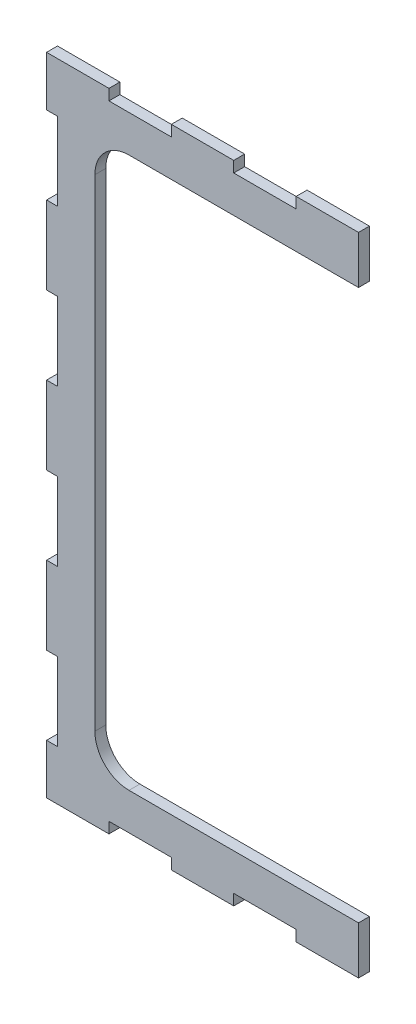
ISO-10303-21;
HEADER;
FILE_DESCRIPTION(('STEP AP214'),'2;1');
FILE_NAME('part.step','',(''),(''),'','','');
FILE_SCHEMA(('AUTOMOTIVE_DESIGN { 1 0 10303 214 1 1 1 1 }'));
ENDSEC;
DATA;
#1=APPLICATION_CONTEXT('core data for automotive mechanical design processes');
#2=APPLICATION_PROTOCOL_DEFINITION('international standard','automotive_design',2000,#1);
#3=PRODUCT_CONTEXT('',#1,'mechanical');
#4=PRODUCT('Part','Part','',(#3));
#5=PRODUCT_RELATED_PRODUCT_CATEGORY('part','',(#4));
#6=PRODUCT_DEFINITION_FORMATION('','',#4);
#7=PRODUCT_DEFINITION_CONTEXT('part definition',#1,'design');
#8=PRODUCT_DEFINITION('design','',#6,#7);
#9=PRODUCT_DEFINITION_SHAPE('','',#8);
#10=(LENGTH_UNIT() NAMED_UNIT(*) SI_UNIT(.MILLI.,.METRE.));
#11=(NAMED_UNIT(*) PLANE_ANGLE_UNIT() SI_UNIT($,.RADIAN.));
#12=(NAMED_UNIT(*) SI_UNIT($,.STERADIAN.) SOLID_ANGLE_UNIT());
#13=UNCERTAINTY_MEASURE_WITH_UNIT(LENGTH_MEASURE(1.E-05),#10,'distance_accuracy_value','');
#14=(GEOMETRIC_REPRESENTATION_CONTEXT(3) GLOBAL_UNCERTAINTY_ASSIGNED_CONTEXT((#13)) GLOBAL_UNIT_ASSIGNED_CONTEXT((#10,
#11,#12)) REPRESENTATION_CONTEXT('',''));
#15=CARTESIAN_POINT('',(0.,0.,0.));
#16=DIRECTION('',(0.,0.,1.));
#17=DIRECTION('',(1.,0.,0.));
#18=AXIS2_PLACEMENT_3D('',#15,#16,#17);
#19=CARTESIAN_POINT('',(-494.301446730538,497.074365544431,16.));
#20=DIRECTION('',(-1.,0.,0.));
#21=DIRECTION('',(0.,-1.,0.));
#22=AXIS2_PLACEMENT_3D('',#19,#20,#21);
#23=PLANE('',#22);
#24=DIRECTION('',(0.,1.,0.));
#25=VECTOR('',#24,1.);
#26=CARTESIAN_POINT('',(-494.301446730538,497.074365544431,0.));
#27=LINE('',#26,#25);
#28=CARTESIAN_POINT('',(-494.301446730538,497.074365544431,0.));
#29=VERTEX_POINT('',#28);
#30=CARTESIAN_POINT('',(-494.301446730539,513.074365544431,0.));
#31=VERTEX_POINT('',#30);
#32=EDGE_CURVE('E325',#29,#31,#27,.T.);
#33=ORIENTED_EDGE('',*,*,#32,.T.);
#34=DIRECTION('',(0.,0.,-1.));
#35=VECTOR('',#34,1.);
#36=CARTESIAN_POINT('',(-494.301446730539,513.074365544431,16.));
#37=LINE('',#36,#35);
#38=CARTESIAN_POINT('',(-494.301446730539,513.074365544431,16.));
#39=VERTEX_POINT('',#38);
#40=EDGE_CURVE('E306',#39,#31,#37,.T.);
#41=ORIENTED_EDGE('',*,*,#40,.F.);
#42=DIRECTION('',(0.,1.,0.));
#43=VECTOR('',#42,1.);
#44=CARTESIAN_POINT('',(-494.301446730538,497.074365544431,16.));
#45=LINE('',#44,#43);
#46=CARTESIAN_POINT('',(-494.301446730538,497.074365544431,16.));
#47=VERTEX_POINT('',#46);
#48=EDGE_CURVE('E313',#47,#39,#45,.T.);
#49=ORIENTED_EDGE('',*,*,#48,.F.);
#50=DIRECTION('',(0.,0.,-1.));
#51=VECTOR('',#50,1.);
#52=CARTESIAN_POINT('',(-494.301446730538,497.074365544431,16.));
#53=LINE('',#52,#51);
#54=EDGE_CURVE('E392',#47,#29,#53,.T.);
#55=ORIENTED_EDGE('',*,*,#54,.T.);
#56=EDGE_LOOP('',(#33,#41,#49,#55));
#57=FACE_BOUND('',#56,.T.);
#58=ADVANCED_FACE('F33',(#57),#23,.F.);
#59=CARTESIAN_POINT('',(-585.741446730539,513.074365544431,16.));
#60=DIRECTION('',(0.,-1.,0.));
#61=DIRECTION('',(0.,0.,-1.));
#62=AXIS2_PLACEMENT_3D('',#59,#60,#61);
#63=PLANE('',#62);
#64=DIRECTION('',(-1.,0.,0.));
#65=VECTOR('',#64,1.);
#66=CARTESIAN_POINT('',(-585.741446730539,513.074365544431,0.));
#67=LINE('',#66,#65);
#68=CARTESIAN_POINT('',(-585.741446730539,513.074365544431,0.));
#69=VERTEX_POINT('',#68);
#70=EDGE_CURVE('E511',#31,#69,#67,.T.);
#71=ORIENTED_EDGE('',*,*,#70,.T.);
#72=DIRECTION('',(0.,0.,-1.));
#73=VECTOR('',#72,1.);
#74=CARTESIAN_POINT('',(-585.741446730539,513.074365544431,16.));
#75=LINE('',#74,#73);
#76=CARTESIAN_POINT('',(-585.741446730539,513.074365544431,16.));
#77=VERTEX_POINT('',#76);
#78=EDGE_CURVE('E309',#77,#69,#75,.T.);
#79=ORIENTED_EDGE('',*,*,#78,.F.);
#80=DIRECTION('',(-1.,0.,0.));
#81=VECTOR('',#80,1.);
#82=CARTESIAN_POINT('',(-585.741446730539,513.074365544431,16.));
#83=LINE('',#82,#81);
#84=EDGE_CURVE('E302',#39,#77,#83,.T.);
#85=ORIENTED_EDGE('',*,*,#84,.F.);
#86=ORIENTED_EDGE('',*,*,#40,.T.);
#87=EDGE_LOOP('',(#71,#79,#85,#86));
#88=FACE_BOUND('',#87,.T.);
#89=ADVANCED_FACE('F304',(#88),#63,.F.);
#90=CARTESIAN_POINT('',(-585.741446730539,439.922365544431,16.));
#91=DIRECTION('',(1.,0.,0.));
#92=DIRECTION('',(0.,0.,-1.));
#93=AXIS2_PLACEMENT_3D('',#90,#91,#92);
#94=PLANE('',#93);
#95=DIRECTION('',(0.,-1.,0.));
#96=VECTOR('',#95,1.);
#97=CARTESIAN_POINT('',(-585.741446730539,439.922365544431,0.));
#98=LINE('',#97,#96);
#99=CARTESIAN_POINT('',(-585.741446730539,439.922365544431,0.));
#100=VERTEX_POINT('',#99);
#101=EDGE_CURVE('E505',#69,#100,#98,.T.);
#102=ORIENTED_EDGE('',*,*,#101,.T.);
#103=DIRECTION('',(0.,0.,-1.));
#104=VECTOR('',#103,1.);
#105=CARTESIAN_POINT('',(-585.741446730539,439.922365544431,16.));
#106=LINE('',#105,#104);
#107=CARTESIAN_POINT('',(-585.741446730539,439.922365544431,16.));
#108=VERTEX_POINT('',#107);
#109=EDGE_CURVE('E331',#108,#100,#106,.T.);
#110=ORIENTED_EDGE('',*,*,#109,.F.);
#111=DIRECTION('',(0.,-1.,0.));
#112=VECTOR('',#111,1.);
#113=CARTESIAN_POINT('',(-585.741446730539,439.922365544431,16.));
#114=LINE('',#113,#112);
#115=EDGE_CURVE('E312',#77,#108,#114,.T.);
#116=ORIENTED_EDGE('',*,*,#115,.F.);
#117=ORIENTED_EDGE('',*,*,#78,.T.);
#118=EDGE_LOOP('',(#102,#110,#116,#117));
#119=FACE_BOUND('',#118,.T.);
#120=ADVANCED_FACE('F590',(#119),#94,.F.);
#121=CARTESIAN_POINT('',(-585.741446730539,439.922365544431,16.));
#122=DIRECTION('',(0.,1.,0.));
#123=DIRECTION('',(-1.,0.,0.));
#124=AXIS2_PLACEMENT_3D('',#121,#122,#123);
#125=PLANE('',#124);
#126=DIRECTION('',(1.,0.,0.));
#127=VECTOR('',#126,1.);
#128=CARTESIAN_POINT('',(-585.741446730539,439.922365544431,0.));
#129=LINE('',#128,#127);
#130=CARTESIAN_POINT('',(-569.741446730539,439.922365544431,0.));
#131=VERTEX_POINT('',#130);
#132=EDGE_CURVE('E500',#100,#131,#129,.T.);
#133=ORIENTED_EDGE('',*,*,#132,.T.);
#134=DIRECTION('',(0.,0.,-1.));
#135=VECTOR('',#134,1.);
#136=CARTESIAN_POINT('',(-569.741446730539,439.922365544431,16.));
#137=LINE('',#136,#135);
#138=CARTESIAN_POINT('',(-569.741446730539,439.922365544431,16.));
#139=VERTEX_POINT('',#138);
#140=EDGE_CURVE('E491',#139,#131,#137,.T.);
#141=ORIENTED_EDGE('',*,*,#140,.F.);
#142=DIRECTION('',(1.,0.,0.));
#143=VECTOR('',#142,1.);
#144=CARTESIAN_POINT('',(-585.741446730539,439.922365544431,16.));
#145=LINE('',#144,#143);
#146=EDGE_CURVE('E501',#108,#139,#145,.T.);
#147=ORIENTED_EDGE('',*,*,#146,.F.);
#148=ORIENTED_EDGE('',*,*,#109,.T.);
#149=EDGE_LOOP('',(#133,#141,#147,#148));
#150=FACE_BOUND('',#149,.T.);
#151=ADVANCED_FACE('F498',(#150),#125,.F.);
#152=CARTESIAN_POINT('',(-569.741446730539,439.922365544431,16.));
#153=DIRECTION('',(1.,0.,0.));
#154=DIRECTION('',(0.,0.,-1.));
#155=AXIS2_PLACEMENT_3D('',#152,#153,#154);
#156=PLANE('',#155);
#157=DIRECTION('',(0.,-1.,0.));
#158=VECTOR('',#157,1.);
#159=CARTESIAN_POINT('',(-569.741446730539,439.922365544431,0.));
#160=LINE('',#159,#158);
#161=CARTESIAN_POINT('',(-569.741446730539,325.622365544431,0.));
#162=VERTEX_POINT('',#161);
#163=EDGE_CURVE('E507',#131,#162,#160,.T.);
#164=ORIENTED_EDGE('',*,*,#163,.T.);
#165=DIRECTION('',(0.,0.,-1.));
#166=VECTOR('',#165,1.);
#167=CARTESIAN_POINT('',(-569.741446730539,325.622365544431,16.));
#168=LINE('',#167,#166);
#169=CARTESIAN_POINT('',(-569.741446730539,325.622365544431,16.));
#170=VERTEX_POINT('',#169);
#171=EDGE_CURVE('E488',#170,#162,#168,.T.);
#172=ORIENTED_EDGE('',*,*,#171,.F.);
#173=DIRECTION('',(0.,-1.,0.));
#174=VECTOR('',#173,1.);
#175=CARTESIAN_POINT('',(-569.741446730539,439.922365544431,16.));
#176=LINE('',#175,#174);
#177=EDGE_CURVE('E592',#139,#170,#176,.T.);
#178=ORIENTED_EDGE('',*,*,#177,.F.);
#179=ORIENTED_EDGE('',*,*,#140,.T.);
#180=EDGE_LOOP('',(#164,#172,#178,#179));
#181=FACE_BOUND('',#180,.T.);
#182=ADVANCED_FACE('F754',(#181),#156,.F.);
#183=CARTESIAN_POINT('',(-585.741446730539,325.622365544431,16.));
#184=DIRECTION('',(0.,-1.,0.));
#185=DIRECTION('',(1.,0.,0.));
#186=AXIS2_PLACEMENT_3D('',#183,#184,#185);
#187=PLANE('',#186);
#188=DIRECTION('',(-1.,0.,0.));
#189=VECTOR('',#188,1.);
#190=CARTESIAN_POINT('',(-585.741446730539,325.622365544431,0.));
#191=LINE('',#190,#189);
#192=CARTESIAN_POINT('',(-585.741446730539,325.622365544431,0.));
#193=VERTEX_POINT('',#192);
#194=EDGE_CURVE('E509',#162,#193,#191,.T.);
#195=ORIENTED_EDGE('',*,*,#194,.T.);
#196=DIRECTION('',(0.,0.,-1.));
#197=VECTOR('',#196,1.);
#198=CARTESIAN_POINT('',(-585.741446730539,325.622365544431,16.));
#199=LINE('',#198,#197);
#200=CARTESIAN_POINT('',(-585.741446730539,325.622365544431,16.));
#201=VERTEX_POINT('',#200);
#202=EDGE_CURVE('E485',#201,#193,#199,.T.);
#203=ORIENTED_EDGE('',*,*,#202,.F.);
#204=DIRECTION('',(-1.,0.,0.));
#205=VECTOR('',#204,1.);
#206=CARTESIAN_POINT('',(-585.741446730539,325.622365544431,16.));
#207=LINE('',#206,#205);
#208=EDGE_CURVE('E596',#170,#201,#207,.T.);
#209=ORIENTED_EDGE('',*,*,#208,.F.);
#210=ORIENTED_EDGE('',*,*,#171,.T.);
#211=EDGE_LOOP('',(#195,#203,#209,#210));
#212=FACE_BOUND('',#211,.T.);
#213=ADVANCED_FACE('F749',(#212),#187,.F.);
#214=CARTESIAN_POINT('',(-585.741446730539,325.622365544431,16.));
#215=DIRECTION('',(1.,0.,0.));
#216=DIRECTION('',(0.,0.,-1.));
#217=AXIS2_PLACEMENT_3D('',#214,#215,#216);
#218=PLANE('',#217);
#219=DIRECTION('',(0.,-1.,0.));
#220=VECTOR('',#219,1.);
#221=CARTESIAN_POINT('',(-585.741446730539,325.622365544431,0.));
#222=LINE('',#221,#220);
#223=CARTESIAN_POINT('',(-585.741446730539,211.323698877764,0.));
#224=VERTEX_POINT('',#223);
#225=EDGE_CURVE('E516',#193,#224,#222,.T.);
#226=ORIENTED_EDGE('',*,*,#225,.T.);
#227=DIRECTION('',(0.,0.,-1.));
#228=VECTOR('',#227,1.);
#229=CARTESIAN_POINT('',(-585.741446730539,211.323698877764,16.));
#230=LINE('',#229,#228);
#231=CARTESIAN_POINT('',(-585.741446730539,211.323698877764,16.));
#232=VERTEX_POINT('',#231);
#233=EDGE_CURVE('E482',#232,#224,#230,.T.);
#234=ORIENTED_EDGE('',*,*,#233,.F.);
#235=DIRECTION('',(0.,-1.,0.));
#236=VECTOR('',#235,1.);
#237=CARTESIAN_POINT('',(-585.741446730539,325.622365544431,16.));
#238=LINE('',#237,#236);
#239=EDGE_CURVE('E598',#201,#232,#238,.T.);
#240=ORIENTED_EDGE('',*,*,#239,.F.);
#241=ORIENTED_EDGE('',*,*,#202,.T.);
#242=EDGE_LOOP('',(#226,#234,#240,#241));
#243=FACE_BOUND('',#242,.T.);
#244=ADVANCED_FACE('F746',(#243),#218,.F.);
#245=CARTESIAN_POINT('',(-585.741446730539,211.323698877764,16.));
#246=DIRECTION('',(0.,1.,0.));
#247=DIRECTION('',(-1.,0.,0.));
#248=AXIS2_PLACEMENT_3D('',#245,#246,#247);
#249=PLANE('',#248);
#250=DIRECTION('',(1.,0.,0.));
#251=VECTOR('',#250,1.);
#252=CARTESIAN_POINT('',(-585.741446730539,211.323698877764,0.));
#253=LINE('',#252,#251);
#254=CARTESIAN_POINT('',(-569.741446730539,211.323698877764,0.));
#255=VERTEX_POINT('',#254);
#256=EDGE_CURVE('E518',#224,#255,#253,.T.);
#257=ORIENTED_EDGE('',*,*,#256,.T.);
#258=DIRECTION('',(0.,0.,-1.));
#259=VECTOR('',#258,1.);
#260=CARTESIAN_POINT('',(-569.741446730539,211.323698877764,16.));
#261=LINE('',#260,#259);
#262=CARTESIAN_POINT('',(-569.741446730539,211.323698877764,16.));
#263=VERTEX_POINT('',#262);
#264=EDGE_CURVE('E479',#263,#255,#261,.T.);
#265=ORIENTED_EDGE('',*,*,#264,.F.);
#266=DIRECTION('',(1.,0.,0.));
#267=VECTOR('',#266,1.);
#268=CARTESIAN_POINT('',(-585.741446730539,211.323698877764,16.));
#269=LINE('',#268,#267);
#270=EDGE_CURVE('E600',#232,#263,#269,.T.);
#271=ORIENTED_EDGE('',*,*,#270,.F.);
#272=ORIENTED_EDGE('',*,*,#233,.T.);
#273=EDGE_LOOP('',(#257,#265,#271,#272));
#274=FACE_BOUND('',#273,.T.);
#275=ADVANCED_FACE('F742',(#274),#249,.F.);
#276=CARTESIAN_POINT('',(-569.741446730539,211.323698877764,16.));
#277=DIRECTION('',(1.,0.,0.));
#278=DIRECTION('',(0.,0.,-1.));
#279=AXIS2_PLACEMENT_3D('',#276,#277,#278);
#280=PLANE('',#279);
#281=DIRECTION('',(0.,-1.,0.));
#282=VECTOR('',#281,1.);
#283=CARTESIAN_POINT('',(-569.741446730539,211.323698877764,0.));
#284=LINE('',#283,#282);
#285=CARTESIAN_POINT('',(-569.741446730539,97.0236988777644,0.));
#286=VERTEX_POINT('',#285);
#287=EDGE_CURVE('E520',#255,#286,#284,.T.);
#288=ORIENTED_EDGE('',*,*,#287,.T.);
#289=DIRECTION('',(0.,0.,-1.));
#290=VECTOR('',#289,1.);
#291=CARTESIAN_POINT('',(-569.741446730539,97.0236988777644,16.));
#292=LINE('',#291,#290);
#293=CARTESIAN_POINT('',(-569.741446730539,97.0236988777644,16.));
#294=VERTEX_POINT('',#293);
#295=EDGE_CURVE('E476',#294,#286,#292,.T.);
#296=ORIENTED_EDGE('',*,*,#295,.F.);
#297=DIRECTION('',(0.,-1.,0.));
#298=VECTOR('',#297,1.);
#299=CARTESIAN_POINT('',(-569.741446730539,211.323698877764,16.));
#300=LINE('',#299,#298);
#301=EDGE_CURVE('E602',#263,#294,#300,.T.);
#302=ORIENTED_EDGE('',*,*,#301,.F.);
#303=ORIENTED_EDGE('',*,*,#264,.T.);
#304=EDGE_LOOP('',(#288,#296,#302,#303));
#305=FACE_BOUND('',#304,.T.);
#306=ADVANCED_FACE('F737',(#305),#280,.F.);
#307=CARTESIAN_POINT('',(-585.741446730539,97.0236988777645,16.));
#308=DIRECTION('',(0.,-1.,0.));
#309=DIRECTION('',(1.,0.,0.));
#310=AXIS2_PLACEMENT_3D('',#307,#308,#309);
#311=PLANE('',#310);
#312=DIRECTION('',(-1.,0.,0.));
#313=VECTOR('',#312,1.);
#314=CARTESIAN_POINT('',(-585.741446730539,97.0236988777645,0.));
#315=LINE('',#314,#313);
#316=CARTESIAN_POINT('',(-585.741446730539,97.0236988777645,0.));
#317=VERTEX_POINT('',#316);
#318=EDGE_CURVE('E522',#286,#317,#315,.T.);
#319=ORIENTED_EDGE('',*,*,#318,.T.);
#320=DIRECTION('',(0.,0.,-1.));
#321=VECTOR('',#320,1.);
#322=CARTESIAN_POINT('',(-585.741446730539,97.0236988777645,16.));
#323=LINE('',#322,#321);
#324=CARTESIAN_POINT('',(-585.741446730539,97.0236988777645,16.));
#325=VERTEX_POINT('',#324);
#326=EDGE_CURVE('E473',#325,#317,#323,.T.);
#327=ORIENTED_EDGE('',*,*,#326,.F.);
#328=DIRECTION('',(-1.,0.,0.));
#329=VECTOR('',#328,1.);
#330=CARTESIAN_POINT('',(-585.741446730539,97.0236988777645,16.));
#331=LINE('',#330,#329);
#332=EDGE_CURVE('E604',#294,#325,#331,.T.);
#333=ORIENTED_EDGE('',*,*,#332,.F.);
#334=ORIENTED_EDGE('',*,*,#295,.T.);
#335=EDGE_LOOP('',(#319,#327,#333,#334));
#336=FACE_BOUND('',#335,.T.);
#337=ADVANCED_FACE('F731',(#336),#311,.F.);
#338=CARTESIAN_POINT('',(-585.741446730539,-17.2749677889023,16.));
#339=DIRECTION('',(1.,0.,0.));
#340=DIRECTION('',(0.,0.,-1.));
#341=AXIS2_PLACEMENT_3D('',#338,#339,#340);
#342=PLANE('',#341);
#343=DIRECTION('',(0.,-1.,0.));
#344=VECTOR('',#343,1.);
#345=CARTESIAN_POINT('',(-585.741446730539,-17.2749677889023,0.));
#346=LINE('',#345,#344);
#347=CARTESIAN_POINT('',(-585.741446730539,-17.2749677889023,0.));
#348=VERTEX_POINT('',#347);
#349=EDGE_CURVE('E524',#317,#348,#346,.T.);
#350=ORIENTED_EDGE('',*,*,#349,.T.);
#351=DIRECTION('',(0.,0.,-1.));
#352=VECTOR('',#351,1.);
#353=CARTESIAN_POINT('',(-585.741446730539,-17.2749677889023,16.));
#354=LINE('',#353,#352);
#355=CARTESIAN_POINT('',(-585.741446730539,-17.2749677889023,16.));
#356=VERTEX_POINT('',#355);
#357=EDGE_CURVE('E470',#356,#348,#354,.T.);
#358=ORIENTED_EDGE('',*,*,#357,.F.);
#359=DIRECTION('',(0.,-1.,0.));
#360=VECTOR('',#359,1.);
#361=CARTESIAN_POINT('',(-585.741446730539,-17.2749677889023,16.));
#362=LINE('',#361,#360);
#363=EDGE_CURVE('E606',#325,#356,#362,.T.);
#364=ORIENTED_EDGE('',*,*,#363,.F.);
#365=ORIENTED_EDGE('',*,*,#326,.T.);
#366=EDGE_LOOP('',(#350,#358,#364,#365));
#367=FACE_BOUND('',#366,.T.);
#368=ADVANCED_FACE('F727',(#367),#342,.F.);
#369=CARTESIAN_POINT('',(-585.741446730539,-17.2749677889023,16.));
#370=DIRECTION('',(0.,1.,0.));
#371=DIRECTION('',(-1.,0.,0.));
#372=AXIS2_PLACEMENT_3D('',#369,#370,#371);
#373=PLANE('',#372);
#374=DIRECTION('',(1.,0.,0.));
#375=VECTOR('',#374,1.);
#376=CARTESIAN_POINT('',(-585.741446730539,-17.2749677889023,0.));
#377=LINE('',#376,#375);
#378=CARTESIAN_POINT('',(-569.741446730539,-17.2749677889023,0.));
#379=VERTEX_POINT('',#378);
#380=EDGE_CURVE('E526',#348,#379,#377,.T.);
#381=ORIENTED_EDGE('',*,*,#380,.T.);
#382=DIRECTION('',(0.,0.,-1.));
#383=VECTOR('',#382,1.);
#384=CARTESIAN_POINT('',(-569.741446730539,-17.2749677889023,16.));
#385=LINE('',#384,#383);
#386=CARTESIAN_POINT('',(-569.741446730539,-17.2749677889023,16.));
#387=VERTEX_POINT('',#386);
#388=EDGE_CURVE('E467',#387,#379,#385,.T.);
#389=ORIENTED_EDGE('',*,*,#388,.F.);
#390=DIRECTION('',(1.,0.,0.));
#391=VECTOR('',#390,1.);
#392=CARTESIAN_POINT('',(-585.741446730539,-17.2749677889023,16.));
#393=LINE('',#392,#391);
#394=EDGE_CURVE('E608',#356,#387,#393,.T.);
#395=ORIENTED_EDGE('',*,*,#394,.F.);
#396=ORIENTED_EDGE('',*,*,#357,.T.);
#397=EDGE_LOOP('',(#381,#389,#395,#396));
#398=FACE_BOUND('',#397,.T.);
#399=ADVANCED_FACE('F722',(#398),#373,.F.);
#400=CARTESIAN_POINT('',(-569.741446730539,-17.2749677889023,16.));
#401=DIRECTION('',(1.,0.,0.));
#402=DIRECTION('',(0.,0.,-1.));
#403=AXIS2_PLACEMENT_3D('',#400,#401,#402);
#404=PLANE('',#403);
#405=DIRECTION('',(0.,-1.,0.));
#406=VECTOR('',#405,1.);
#407=CARTESIAN_POINT('',(-569.741446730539,-17.2749677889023,0.));
#408=LINE('',#407,#406);
#409=CARTESIAN_POINT('',(-569.741446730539,-131.574967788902,0.));
#410=VERTEX_POINT('',#409);
#411=EDGE_CURVE('E528',#379,#410,#408,.T.);
#412=ORIENTED_EDGE('',*,*,#411,.T.);
#413=DIRECTION('',(0.,0.,-1.));
#414=VECTOR('',#413,1.);
#415=CARTESIAN_POINT('',(-569.741446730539,-131.574967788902,16.));
#416=LINE('',#415,#414);
#417=CARTESIAN_POINT('',(-569.741446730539,-131.574967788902,16.));
#418=VERTEX_POINT('',#417);
#419=EDGE_CURVE('E464',#418,#410,#416,.T.);
#420=ORIENTED_EDGE('',*,*,#419,.F.);
#421=DIRECTION('',(0.,-1.,0.));
#422=VECTOR('',#421,1.);
#423=CARTESIAN_POINT('',(-569.741446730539,-17.2749677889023,16.));
#424=LINE('',#423,#422);
#425=EDGE_CURVE('E610',#387,#418,#424,.T.);
#426=ORIENTED_EDGE('',*,*,#425,.F.);
#427=ORIENTED_EDGE('',*,*,#388,.T.);
#428=EDGE_LOOP('',(#412,#420,#426,#427));
#429=FACE_BOUND('',#428,.T.);
#430=ADVANCED_FACE('F716',(#429),#404,.F.);
#431=CARTESIAN_POINT('',(-585.741446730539,-131.574967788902,16.));
#432=DIRECTION('',(0.,-1.,0.));
#433=DIRECTION('',(1.,0.,0.));
#434=AXIS2_PLACEMENT_3D('',#431,#432,#433);
#435=PLANE('',#434);
#436=DIRECTION('',(-1.,0.,0.));
#437=VECTOR('',#436,1.);
#438=CARTESIAN_POINT('',(-585.741446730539,-131.574967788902,0.));
#439=LINE('',#438,#437);
#440=CARTESIAN_POINT('',(-585.741446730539,-131.574967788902,0.));
#441=VERTEX_POINT('',#440);
#442=EDGE_CURVE('E530',#410,#441,#439,.T.);
#443=ORIENTED_EDGE('',*,*,#442,.T.);
#444=DIRECTION('',(0.,0.,-1.));
#445=VECTOR('',#444,1.);
#446=CARTESIAN_POINT('',(-585.741446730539,-131.574967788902,16.));
#447=LINE('',#446,#445);
#448=CARTESIAN_POINT('',(-585.741446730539,-131.574967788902,16.));
#449=VERTEX_POINT('',#448);
#450=EDGE_CURVE('E461',#449,#441,#447,.T.);
#451=ORIENTED_EDGE('',*,*,#450,.F.);
#452=DIRECTION('',(-1.,0.,0.));
#453=VECTOR('',#452,1.);
#454=CARTESIAN_POINT('',(-585.741446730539,-131.574967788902,16.));
#455=LINE('',#454,#453);
#456=EDGE_CURVE('E612',#418,#449,#455,.T.);
#457=ORIENTED_EDGE('',*,*,#456,.F.);
#458=ORIENTED_EDGE('',*,*,#419,.T.);
#459=EDGE_LOOP('',(#443,#451,#457,#458));
#460=FACE_BOUND('',#459,.T.);
#461=ADVANCED_FACE('F712',(#460),#435,.F.);
#462=CARTESIAN_POINT('',(-585.741446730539,-245.873634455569,16.));
#463=DIRECTION('',(1.,0.,0.));
#464=DIRECTION('',(0.,0.,-1.));
#465=AXIS2_PLACEMENT_3D('',#462,#463,#464);
#466=PLANE('',#465);
#467=DIRECTION('',(0.,-1.,0.));
#468=VECTOR('',#467,1.);
#469=CARTESIAN_POINT('',(-585.741446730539,-245.873634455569,0.));
#470=LINE('',#469,#468);
#471=CARTESIAN_POINT('',(-585.741446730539,-245.873634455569,0.));
#472=VERTEX_POINT('',#471);
#473=EDGE_CURVE('E532',#441,#472,#470,.T.);
#474=ORIENTED_EDGE('',*,*,#473,.T.);
#475=DIRECTION('',(0.,0.,-1.));
#476=VECTOR('',#475,1.);
#477=CARTESIAN_POINT('',(-585.741446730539,-245.873634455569,16.));
#478=LINE('',#477,#476);
#479=CARTESIAN_POINT('',(-585.741446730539,-245.873634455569,16.));
#480=VERTEX_POINT('',#479);
#481=EDGE_CURVE('E458',#480,#472,#478,.T.);
#482=ORIENTED_EDGE('',*,*,#481,.F.);
#483=DIRECTION('',(0.,-1.,0.));
#484=VECTOR('',#483,1.);
#485=CARTESIAN_POINT('',(-585.741446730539,-245.873634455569,16.));
#486=LINE('',#485,#484);
#487=EDGE_CURVE('E614',#449,#480,#486,.T.);
#488=ORIENTED_EDGE('',*,*,#487,.F.);
#489=ORIENTED_EDGE('',*,*,#450,.T.);
#490=EDGE_LOOP('',(#474,#482,#488,#489));
#491=FACE_BOUND('',#490,.T.);
#492=ADVANCED_FACE('F707',(#491),#466,.F.);
#493=CARTESIAN_POINT('',(-585.741446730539,-245.873634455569,16.));
#494=DIRECTION('',(0.,1.,0.));
#495=DIRECTION('',(-1.,0.,0.));
#496=AXIS2_PLACEMENT_3D('',#493,#494,#495);
#497=PLANE('',#496);
#498=DIRECTION('',(1.,0.,0.));
#499=VECTOR('',#498,1.);
#500=CARTESIAN_POINT('',(-585.741446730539,-245.873634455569,0.));
#501=LINE('',#500,#499);
#502=CARTESIAN_POINT('',(-569.741446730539,-245.873634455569,0.));
#503=VERTEX_POINT('',#502);
#504=EDGE_CURVE('E534',#472,#503,#501,.T.);
#505=ORIENTED_EDGE('',*,*,#504,.T.);
#506=DIRECTION('',(0.,0.,-1.));
#507=VECTOR('',#506,1.);
#508=CARTESIAN_POINT('',(-569.741446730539,-245.873634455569,16.));
#509=LINE('',#508,#507);
#510=CARTESIAN_POINT('',(-569.741446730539,-245.873634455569,16.));
#511=VERTEX_POINT('',#510);
#512=EDGE_CURVE('E455',#511,#503,#509,.T.);
#513=ORIENTED_EDGE('',*,*,#512,.F.);
#514=DIRECTION('',(1.,0.,0.));
#515=VECTOR('',#514,1.);
#516=CARTESIAN_POINT('',(-585.741446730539,-245.873634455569,16.));
#517=LINE('',#516,#515);
#518=EDGE_CURVE('E616',#480,#511,#517,.T.);
#519=ORIENTED_EDGE('',*,*,#518,.F.);
#520=ORIENTED_EDGE('',*,*,#481,.T.);
#521=EDGE_LOOP('',(#505,#513,#519,#520));
#522=FACE_BOUND('',#521,.T.);
#523=ADVANCED_FACE('F701',(#522),#497,.F.);
#524=CARTESIAN_POINT('',(-569.741446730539,-245.873634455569,16.));
#525=DIRECTION('',(1.,0.,0.));
#526=DIRECTION('',(0.,0.,-1.));
#527=AXIS2_PLACEMENT_3D('',#524,#525,#526);
#528=PLANE('',#527);
#529=DIRECTION('',(0.,-1.,0.));
#530=VECTOR('',#529,1.);
#531=CARTESIAN_POINT('',(-569.741446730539,-245.873634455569,0.));
#532=LINE('',#531,#530);
#533=CARTESIAN_POINT('',(-569.741446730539,-360.173634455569,0.));
#534=VERTEX_POINT('',#533);
#535=EDGE_CURVE('E536',#503,#534,#532,.T.);
#536=ORIENTED_EDGE('',*,*,#535,.T.);
#537=DIRECTION('',(0.,0.,-1.));
#538=VECTOR('',#537,1.);
#539=CARTESIAN_POINT('',(-569.741446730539,-360.173634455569,16.));
#540=LINE('',#539,#538);
#541=CARTESIAN_POINT('',(-569.741446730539,-360.173634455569,16.));
#542=VERTEX_POINT('',#541);
#543=EDGE_CURVE('E452',#542,#534,#540,.T.);
#544=ORIENTED_EDGE('',*,*,#543,.F.);
#545=DIRECTION('',(0.,-1.,0.));
#546=VECTOR('',#545,1.);
#547=CARTESIAN_POINT('',(-569.741446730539,-245.873634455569,16.));
#548=LINE('',#547,#546);
#549=EDGE_CURVE('E618',#511,#542,#548,.T.);
#550=ORIENTED_EDGE('',*,*,#549,.F.);
#551=ORIENTED_EDGE('',*,*,#512,.T.);
#552=EDGE_LOOP('',(#536,#544,#550,#551));
#553=FACE_BOUND('',#552,.T.);
#554=ADVANCED_FACE('F697',(#553),#528,.F.);
#555=CARTESIAN_POINT('',(-585.741446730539,-360.173634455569,16.));
#556=DIRECTION('',(0.,-1.,0.));
#557=DIRECTION('',(1.,0.,0.));
#558=AXIS2_PLACEMENT_3D('',#555,#556,#557);
#559=PLANE('',#558);
#560=DIRECTION('',(-1.,0.,0.));
#561=VECTOR('',#560,1.);
#562=CARTESIAN_POINT('',(-585.741446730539,-360.173634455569,0.));
#563=LINE('',#562,#561);
#564=CARTESIAN_POINT('',(-585.741446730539,-360.173634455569,0.));
#565=VERTEX_POINT('',#564);
#566=EDGE_CURVE('E538',#534,#565,#563,.T.);
#567=ORIENTED_EDGE('',*,*,#566,.T.);
#568=DIRECTION('',(0.,0.,-1.));
#569=VECTOR('',#568,1.);
#570=CARTESIAN_POINT('',(-585.741446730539,-360.173634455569,16.));
#571=LINE('',#570,#569);
#572=CARTESIAN_POINT('',(-585.741446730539,-360.173634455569,16.));
#573=VERTEX_POINT('',#572);
#574=EDGE_CURVE('E449',#573,#565,#571,.T.);
#575=ORIENTED_EDGE('',*,*,#574,.F.);
#576=DIRECTION('',(-1.,0.,0.));
#577=VECTOR('',#576,1.);
#578=CARTESIAN_POINT('',(-585.741446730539,-360.173634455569,16.));
#579=LINE('',#578,#577);
#580=EDGE_CURVE('E620',#542,#573,#579,.T.);
#581=ORIENTED_EDGE('',*,*,#580,.F.);
#582=ORIENTED_EDGE('',*,*,#543,.T.);
#583=EDGE_LOOP('',(#567,#575,#581,#582));
#584=FACE_BOUND('',#583,.T.);
#585=ADVANCED_FACE('F692',(#584),#559,.F.);
#586=CARTESIAN_POINT('',(-585.741446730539,-433.325634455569,16.));
#587=DIRECTION('',(1.,0.,0.));
#588=DIRECTION('',(0.,0.,-1.));
#589=AXIS2_PLACEMENT_3D('',#586,#587,#588);
#590=PLANE('',#589);
#591=DIRECTION('',(0.,-1.,0.));
#592=VECTOR('',#591,1.);
#593=CARTESIAN_POINT('',(-585.741446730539,-433.325634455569,0.));
#594=LINE('',#593,#592);
#595=CARTESIAN_POINT('',(-585.741446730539,-433.325634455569,0.));
#596=VERTEX_POINT('',#595);
#597=EDGE_CURVE('E540',#565,#596,#594,.T.);
#598=ORIENTED_EDGE('',*,*,#597,.T.);
#599=DIRECTION('',(0.,0.,-1.));
#600=VECTOR('',#599,1.);
#601=CARTESIAN_POINT('',(-585.741446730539,-433.325634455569,16.));
#602=LINE('',#601,#600);
#603=CARTESIAN_POINT('',(-585.741446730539,-433.325634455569,16.));
#604=VERTEX_POINT('',#603);
#605=EDGE_CURVE('E446',#604,#596,#602,.T.);
#606=ORIENTED_EDGE('',*,*,#605,.F.);
#607=DIRECTION('',(0.,-1.,0.));
#608=VECTOR('',#607,1.);
#609=CARTESIAN_POINT('',(-585.741446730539,-433.325634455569,16.));
#610=LINE('',#609,#608);
#611=EDGE_CURVE('E622',#573,#604,#610,.T.);
#612=ORIENTED_EDGE('',*,*,#611,.F.);
#613=ORIENTED_EDGE('',*,*,#574,.T.);
#614=EDGE_LOOP('',(#598,#606,#612,#613));
#615=FACE_BOUND('',#614,.T.);
#616=ADVANCED_FACE('F686',(#615),#590,.F.);
#617=CARTESIAN_POINT('',(-585.741446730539,-433.325634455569,16.));
#618=DIRECTION('',(0.,1.,0.));
#619=DIRECTION('',(0.,0.,1.));
#620=AXIS2_PLACEMENT_3D('',#617,#618,#619);
#621=PLANE('',#620);
#622=DIRECTION('',(1.,0.,0.));
#623=VECTOR('',#622,1.);
#624=CARTESIAN_POINT('',(-585.741446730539,-433.325634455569,0.));
#625=LINE('',#624,#623);
#626=CARTESIAN_POINT('',(-494.301446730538,-433.325634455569,0.));
#627=VERTEX_POINT('',#626);
#628=EDGE_CURVE('E542',#596,#627,#625,.T.);
#629=ORIENTED_EDGE('',*,*,#628,.T.);
#630=DIRECTION('',(0.,0.,-1.));
#631=VECTOR('',#630,1.);
#632=CARTESIAN_POINT('',(-494.301446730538,-433.325634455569,16.));
#633=LINE('',#632,#631);
#634=CARTESIAN_POINT('',(-494.301446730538,-433.325634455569,16.));
#635=VERTEX_POINT('',#634);
#636=EDGE_CURVE('E443',#635,#627,#633,.T.);
#637=ORIENTED_EDGE('',*,*,#636,.F.);
#638=DIRECTION('',(1.,0.,0.));
#639=VECTOR('',#638,1.);
#640=CARTESIAN_POINT('',(-585.741446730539,-433.325634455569,16.));
#641=LINE('',#640,#639);
#642=EDGE_CURVE('E624',#604,#635,#641,.T.);
#643=ORIENTED_EDGE('',*,*,#642,.F.);
#644=ORIENTED_EDGE('',*,*,#605,.T.);
#645=EDGE_LOOP('',(#629,#637,#643,#644));
#646=FACE_BOUND('',#645,.T.);
#647=ADVANCED_FACE('F682',(#646),#621,.F.);
#648=CARTESIAN_POINT('',(-494.301446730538,-417.325634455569,16.));
#649=DIRECTION('',(-1.,0.,0.));
#650=DIRECTION('',(0.,0.,1.));
#651=AXIS2_PLACEMENT_3D('',#648,#649,#650);
#652=PLANE('',#651);
#653=DIRECTION('',(0.,1.,0.));
#654=VECTOR('',#653,1.);
#655=CARTESIAN_POINT('',(-494.301446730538,-417.325634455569,0.));
#656=LINE('',#655,#654);
#657=CARTESIAN_POINT('',(-494.301446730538,-417.325634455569,0.));
#658=VERTEX_POINT('',#657);
#659=EDGE_CURVE('E544',#627,#658,#656,.T.);
#660=ORIENTED_EDGE('',*,*,#659,.T.);
#661=DIRECTION('',(0.,0.,-1.));
#662=VECTOR('',#661,1.);
#663=CARTESIAN_POINT('',(-494.301446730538,-417.325634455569,16.));
#664=LINE('',#663,#662);
#665=CARTESIAN_POINT('',(-494.301446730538,-417.325634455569,16.));
#666=VERTEX_POINT('',#665);
#667=EDGE_CURVE('E440',#666,#658,#664,.T.);
#668=ORIENTED_EDGE('',*,*,#667,.F.);
#669=DIRECTION('',(0.,1.,0.));
#670=VECTOR('',#669,1.);
#671=CARTESIAN_POINT('',(-494.301446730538,-417.325634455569,16.));
#672=LINE('',#671,#670);
#673=EDGE_CURVE('E626',#635,#666,#672,.T.);
#674=ORIENTED_EDGE('',*,*,#673,.F.);
#675=ORIENTED_EDGE('',*,*,#636,.T.);
#676=EDGE_LOOP('',(#660,#668,#674,#675));
#677=FACE_BOUND('',#676,.T.);
#678=ADVANCED_FACE('F677',(#677),#652,.F.);
#679=CARTESIAN_POINT('',(-494.301446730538,-417.325634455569,16.));
#680=DIRECTION('',(0.,1.,0.));
#681=DIRECTION('',(0.,0.,1.));
#682=AXIS2_PLACEMENT_3D('',#679,#680,#681);
#683=PLANE('',#682);
#684=DIRECTION('',(1.,0.,0.));
#685=VECTOR('',#684,1.);
#686=CARTESIAN_POINT('',(-494.301446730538,-417.325634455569,0.));
#687=LINE('',#686,#685);
#688=CARTESIAN_POINT('',(-402.861446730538,-417.325634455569,0.));
#689=VERTEX_POINT('',#688);
#690=EDGE_CURVE('E546',#658,#689,#687,.T.);
#691=ORIENTED_EDGE('',*,*,#690,.T.);
#692=DIRECTION('',(0.,0.,-1.));
#693=VECTOR('',#692,1.);
#694=CARTESIAN_POINT('',(-402.861446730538,-417.325634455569,16.));
#695=LINE('',#694,#693);
#696=CARTESIAN_POINT('',(-402.861446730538,-417.325634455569,16.));
#697=VERTEX_POINT('',#696);
#698=EDGE_CURVE('E437',#697,#689,#695,.T.);
#699=ORIENTED_EDGE('',*,*,#698,.F.);
#700=DIRECTION('',(1.,0.,0.));
#701=VECTOR('',#700,1.);
#702=CARTESIAN_POINT('',(-494.301446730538,-417.325634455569,16.));
#703=LINE('',#702,#701);
#704=EDGE_CURVE('E628',#666,#697,#703,.T.);
#705=ORIENTED_EDGE('',*,*,#704,.F.);
#706=ORIENTED_EDGE('',*,*,#667,.T.);
#707=EDGE_LOOP('',(#691,#699,#705,#706));
#708=FACE_BOUND('',#707,.T.);
#709=ADVANCED_FACE('F671',(#708),#683,.F.);
#710=CARTESIAN_POINT('',(-402.861446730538,-417.325634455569,16.));
#711=DIRECTION('',(1.,0.,0.));
#712=DIRECTION('',(0.,1.,0.));
#713=AXIS2_PLACEMENT_3D('',#710,#711,#712);
#714=PLANE('',#713);
#715=DIRECTION('',(0.,-1.,0.));
#716=VECTOR('',#715,1.);
#717=CARTESIAN_POINT('',(-402.861446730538,-417.325634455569,0.));
#718=LINE('',#717,#716);
#719=CARTESIAN_POINT('',(-402.861446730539,-433.325634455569,0.));
#720=VERTEX_POINT('',#719);
#721=EDGE_CURVE('E548',#689,#720,#718,.T.);
#722=ORIENTED_EDGE('',*,*,#721,.T.);
#723=DIRECTION('',(0.,0.,-1.));
#724=VECTOR('',#723,1.);
#725=CARTESIAN_POINT('',(-402.861446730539,-433.325634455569,16.));
#726=LINE('',#725,#724);
#727=CARTESIAN_POINT('',(-402.861446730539,-433.325634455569,16.));
#728=VERTEX_POINT('',#727);
#729=EDGE_CURVE('E434',#728,#720,#726,.T.);
#730=ORIENTED_EDGE('',*,*,#729,.F.);
#731=DIRECTION('',(0.,-1.,0.));
#732=VECTOR('',#731,1.);
#733=CARTESIAN_POINT('',(-402.861446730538,-417.325634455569,16.));
#734=LINE('',#733,#732);
#735=EDGE_CURVE('E630',#697,#728,#734,.T.);
#736=ORIENTED_EDGE('',*,*,#735,.F.);
#737=ORIENTED_EDGE('',*,*,#698,.T.);
#738=EDGE_LOOP('',(#722,#730,#736,#737));
#739=FACE_BOUND('',#738,.T.);
#740=ADVANCED_FACE('F667',(#739),#714,.F.);
#741=CARTESIAN_POINT('',(-402.861446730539,-433.325634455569,16.));
#742=DIRECTION('',(0.,1.,0.));
#743=DIRECTION('',(0.,0.,1.));
#744=AXIS2_PLACEMENT_3D('',#741,#742,#743);
#745=PLANE('',#744);
#746=DIRECTION('',(1.,0.,0.));
#747=VECTOR('',#746,1.);
#748=CARTESIAN_POINT('',(-402.861446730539,-433.325634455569,0.));
#749=LINE('',#748,#747);
#750=CARTESIAN_POINT('',(-311.421446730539,-433.325634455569,0.));
#751=VERTEX_POINT('',#750);
#752=EDGE_CURVE('E550',#720,#751,#749,.T.);
#753=ORIENTED_EDGE('',*,*,#752,.T.);
#754=DIRECTION('',(0.,0.,-1.));
#755=VECTOR('',#754,1.);
#756=CARTESIAN_POINT('',(-311.421446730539,-433.325634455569,16.));
#757=LINE('',#756,#755);
#758=CARTESIAN_POINT('',(-311.421446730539,-433.325634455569,16.));
#759=VERTEX_POINT('',#758);
#760=EDGE_CURVE('E431',#759,#751,#757,.T.);
#761=ORIENTED_EDGE('',*,*,#760,.F.);
#762=DIRECTION('',(1.,0.,0.));
#763=VECTOR('',#762,1.);
#764=CARTESIAN_POINT('',(-402.861446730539,-433.325634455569,16.));
#765=LINE('',#764,#763);
#766=EDGE_CURVE('E632',#728,#759,#765,.T.);
#767=ORIENTED_EDGE('',*,*,#766,.F.);
#768=ORIENTED_EDGE('',*,*,#729,.T.);
#769=EDGE_LOOP('',(#753,#761,#767,#768));
#770=FACE_BOUND('',#769,.T.);
#771=ADVANCED_FACE('F662',(#770),#745,.F.);
#772=CARTESIAN_POINT('',(-311.421446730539,-417.325634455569,16.));
#773=DIRECTION('',(-1.,0.,0.));
#774=DIRECTION('',(0.,-1.,0.));
#775=AXIS2_PLACEMENT_3D('',#772,#773,#774);
#776=PLANE('',#775);
#777=DIRECTION('',(0.,1.,0.));
#778=VECTOR('',#777,1.);
#779=CARTESIAN_POINT('',(-311.421446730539,-417.325634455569,0.));
#780=LINE('',#779,#778);
#781=CARTESIAN_POINT('',(-311.421446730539,-417.325634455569,0.));
#782=VERTEX_POINT('',#781);
#783=EDGE_CURVE('E552',#751,#782,#780,.T.);
#784=ORIENTED_EDGE('',*,*,#783,.T.);
#785=DIRECTION('',(0.,0.,-1.));
#786=VECTOR('',#785,1.);
#787=CARTESIAN_POINT('',(-311.421446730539,-417.325634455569,16.));
#788=LINE('',#787,#786);
#789=CARTESIAN_POINT('',(-311.421446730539,-417.325634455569,16.));
#790=VERTEX_POINT('',#789);
#791=EDGE_CURVE('E428',#790,#782,#788,.T.);
#792=ORIENTED_EDGE('',*,*,#791,.F.);
#793=DIRECTION('',(0.,1.,0.));
#794=VECTOR('',#793,1.);
#795=CARTESIAN_POINT('',(-311.421446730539,-417.325634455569,16.));
#796=LINE('',#795,#794);
#797=EDGE_CURVE('E634',#759,#790,#796,.T.);
#798=ORIENTED_EDGE('',*,*,#797,.F.);
#799=ORIENTED_EDGE('',*,*,#760,.T.);
#800=EDGE_LOOP('',(#784,#792,#798,#799));
#801=FACE_BOUND('',#800,.T.);
#802=ADVANCED_FACE('F656',(#801),#776,.F.);
#803=CARTESIAN_POINT('',(-311.421446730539,-417.325634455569,16.));
#804=DIRECTION('',(0.,1.,0.));
#805=DIRECTION('',(0.,0.,1.));
#806=AXIS2_PLACEMENT_3D('',#803,#804,#805);
#807=PLANE('',#806);
#808=DIRECTION('',(1.,0.,0.));
#809=VECTOR('',#808,1.);
#810=CARTESIAN_POINT('',(-311.421446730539,-417.325634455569,0.));
#811=LINE('',#810,#809);
#812=CARTESIAN_POINT('',(-219.981446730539,-417.325634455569,0.));
#813=VERTEX_POINT('',#812);
#814=EDGE_CURVE('E554',#782,#813,#811,.T.);
#815=ORIENTED_EDGE('',*,*,#814,.T.);
#816=DIRECTION('',(0.,0.,-1.));
#817=VECTOR('',#816,1.);
#818=CARTESIAN_POINT('',(-219.981446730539,-417.325634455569,16.));
#819=LINE('',#818,#817);
#820=CARTESIAN_POINT('',(-219.981446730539,-417.325634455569,16.));
#821=VERTEX_POINT('',#820);
#822=EDGE_CURVE('E425',#821,#813,#819,.T.);
#823=ORIENTED_EDGE('',*,*,#822,.F.);
#824=DIRECTION('',(1.,0.,0.));
#825=VECTOR('',#824,1.);
#826=CARTESIAN_POINT('',(-311.421446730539,-417.325634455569,16.));
#827=LINE('',#826,#825);
#828=EDGE_CURVE('E636',#790,#821,#827,.T.);
#829=ORIENTED_EDGE('',*,*,#828,.F.);
#830=ORIENTED_EDGE('',*,*,#791,.T.);
#831=EDGE_LOOP('',(#815,#823,#829,#830));
#832=FACE_BOUND('',#831,.T.);
#833=ADVANCED_FACE('F652',(#832),#807,.F.);
#834=CARTESIAN_POINT('',(-219.981446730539,-417.325634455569,16.));
#835=DIRECTION('',(1.,0.,0.));
#836=DIRECTION('',(0.,0.,-1.));
#837=AXIS2_PLACEMENT_3D('',#834,#835,#836);
#838=PLANE('',#837);
#839=DIRECTION('',(0.,-1.,0.));
#840=VECTOR('',#839,1.);
#841=CARTESIAN_POINT('',(-219.981446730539,-417.325634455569,0.));
#842=LINE('',#841,#840);
#843=CARTESIAN_POINT('',(-219.981446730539,-433.325634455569,0.));
#844=VERTEX_POINT('',#843);
#845=EDGE_CURVE('E556',#813,#844,#842,.T.);
#846=ORIENTED_EDGE('',*,*,#845,.T.);
#847=DIRECTION('',(0.,0.,-1.));
#848=VECTOR('',#847,1.);
#849=CARTESIAN_POINT('',(-219.981446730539,-433.325634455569,16.));
#850=LINE('',#849,#848);
#851=CARTESIAN_POINT('',(-219.981446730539,-433.325634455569,16.));
#852=VERTEX_POINT('',#851);
#853=EDGE_CURVE('E422',#852,#844,#850,.T.);
#854=ORIENTED_EDGE('',*,*,#853,.F.);
#855=DIRECTION('',(0.,-1.,0.));
#856=VECTOR('',#855,1.);
#857=CARTESIAN_POINT('',(-219.981446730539,-417.325634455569,16.));
#858=LINE('',#857,#856);
#859=EDGE_CURVE('E638',#821,#852,#858,.T.);
#860=ORIENTED_EDGE('',*,*,#859,.F.);
#861=ORIENTED_EDGE('',*,*,#822,.T.);
#862=EDGE_LOOP('',(#846,#854,#860,#861));
#863=FACE_BOUND('',#862,.T.);
#864=ADVANCED_FACE('F648',(#863),#838,.F.);
#865=CARTESIAN_POINT('',(-219.981446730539,-433.325634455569,16.));
#866=DIRECTION('',(0.,1.,0.));
#867=DIRECTION('',(0.,0.,1.));
#868=AXIS2_PLACEMENT_3D('',#865,#866,#867);
#869=PLANE('',#868);
#870=DIRECTION('',(1.,0.,0.));
#871=VECTOR('',#870,1.);
#872=CARTESIAN_POINT('',(-219.981446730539,-433.325634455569,0.));
#873=LINE('',#872,#871);
#874=CARTESIAN_POINT('',(-128.541446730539,-433.325634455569,0.));
#875=VERTEX_POINT('',#874);
#876=EDGE_CURVE('E558',#844,#875,#873,.T.);
#877=ORIENTED_EDGE('',*,*,#876,.T.);
#878=DIRECTION('',(0.,0.,-1.));
#879=VECTOR('',#878,1.);
#880=CARTESIAN_POINT('',(-128.541446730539,-433.325634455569,16.));
#881=LINE('',#880,#879);
#882=CARTESIAN_POINT('',(-128.541446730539,-433.325634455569,16.));
#883=VERTEX_POINT('',#882);
#884=EDGE_CURVE('E419',#883,#875,#881,.T.);
#885=ORIENTED_EDGE('',*,*,#884,.F.);
#886=DIRECTION('',(1.,0.,0.));
#887=VECTOR('',#886,1.);
#888=CARTESIAN_POINT('',(-219.981446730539,-433.325634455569,16.));
#889=LINE('',#888,#887);
#890=EDGE_CURVE('E572',#852,#883,#889,.T.);
#891=ORIENTED_EDGE('',*,*,#890,.F.);
#892=ORIENTED_EDGE('',*,*,#853,.T.);
#893=EDGE_LOOP('',(#877,#885,#891,#892));
#894=FACE_BOUND('',#893,.T.);
#895=ADVANCED_FACE('F643',(#894),#869,.F.);
#896=CARTESIAN_POINT('',(-128.541446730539,-363.325634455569,16.));
#897=DIRECTION('',(-1.,0.,0.));
#898=DIRECTION('',(0.,-1.,0.));
#899=AXIS2_PLACEMENT_3D('',#896,#897,#898);
#900=PLANE('',#899);
#901=DIRECTION('',(0.,1.,0.));
#902=VECTOR('',#901,1.);
#903=CARTESIAN_POINT('',(-128.541446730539,-363.325634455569,0.));
#904=LINE('',#903,#902);
#905=CARTESIAN_POINT('',(-128.541446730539,-363.325634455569,0.));
#906=VERTEX_POINT('',#905);
#907=EDGE_CURVE('E374',#875,#906,#904,.T.);
#908=ORIENTED_EDGE('',*,*,#907,.T.);
#909=DIRECTION('',(0.,0.,-1.));
#910=VECTOR('',#909,1.);
#911=CARTESIAN_POINT('',(-128.541446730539,-363.325634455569,16.));
#912=LINE('',#911,#910);
#913=CARTESIAN_POINT('',(-128.541446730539,-363.325634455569,16.));
#914=VERTEX_POINT('',#913);
#915=EDGE_CURVE('E416',#914,#906,#912,.T.);
#916=ORIENTED_EDGE('',*,*,#915,.F.);
#917=DIRECTION('',(0.,1.,0.));
#918=VECTOR('',#917,1.);
#919=CARTESIAN_POINT('',(-128.541446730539,-363.325634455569,16.));
#920=LINE('',#919,#918);
#921=EDGE_CURVE('E569',#883,#914,#920,.T.);
#922=ORIENTED_EDGE('',*,*,#921,.F.);
#923=ORIENTED_EDGE('',*,*,#884,.T.);
#924=EDGE_LOOP('',(#908,#916,#922,#923));
#925=FACE_BOUND('',#924,.T.);
#926=ADVANCED_FACE('F562',(#925),#900,.F.);
#927=CARTESIAN_POINT('',(-514.981446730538,-363.325634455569,16.));
#928=DIRECTION('',(0.,-1.,0.));
#929=DIRECTION('',(0.,0.,-1.));
#930=AXIS2_PLACEMENT_3D('',#927,#928,#929);
#931=PLANE('',#930);
#932=DIRECTION('',(-1.,0.,0.));
#933=VECTOR('',#932,1.);
#934=CARTESIAN_POINT('',(-514.981446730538,-363.325634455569,0.));
#935=LINE('',#934,#933);
#936=CARTESIAN_POINT('',(-464.981446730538,-363.325634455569,0.));
#937=VERTEX_POINT('',#936);
#938=EDGE_CURVE('E370',#906,#937,#935,.T.);
#939=ORIENTED_EDGE('',*,*,#938,.T.);
#940=DIRECTION('',(0.,0.,-1.));
#941=VECTOR('',#940,1.);
#942=CARTESIAN_POINT('',(-464.981446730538,-363.325634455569,16.));
#943=LINE('',#942,#941);
#944=CARTESIAN_POINT('',(-464.981446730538,-363.325634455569,16.));
#945=VERTEX_POINT('',#944);
#946=EDGE_CURVE('E48',#937,#945,#943,.F.);
#947=ORIENTED_EDGE('',*,*,#946,.T.);
#948=DIRECTION('',(-1.,0.,0.));
#949=VECTOR('',#948,1.);
#950=CARTESIAN_POINT('',(-514.981446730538,-363.325634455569,16.));
#951=LINE('',#950,#949);
#952=EDGE_CURVE('E567',#914,#945,#951,.T.);
#953=ORIENTED_EDGE('',*,*,#952,.F.);
#954=ORIENTED_EDGE('',*,*,#915,.T.);
#955=EDGE_LOOP('',(#939,#947,#953,#954));
#956=FACE_BOUND('',#955,.T.);
#957=ADVANCED_FACE('F566',(#956),#931,.F.);
#958=CARTESIAN_POINT('',(-514.981446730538,443.074365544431,16.));
#959=DIRECTION('',(-1.,0.,0.));
#960=DIRECTION('',(0.,-1.,0.));
#961=AXIS2_PLACEMENT_3D('',#958,#959,#960);
#962=PLANE('',#961);
#963=DIRECTION('',(0.,1.,0.));
#964=VECTOR('',#963,1.);
#965=CARTESIAN_POINT('',(-514.981446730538,443.074365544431,0.));
#966=LINE('',#965,#964);
#967=CARTESIAN_POINT('',(-514.981446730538,-313.325634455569,0.));
#968=VERTEX_POINT('',#967);
#969=CARTESIAN_POINT('',(-514.981446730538,393.074365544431,0.));
#970=VERTEX_POINT('',#969);
#971=EDGE_CURVE('E364',#968,#970,#966,.T.);
#972=ORIENTED_EDGE('',*,*,#971,.T.);
#973=DIRECTION('',(0.,0.,-1.));
#974=VECTOR('',#973,1.);
#975=CARTESIAN_POINT('',(-514.981446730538,393.074365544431,16.));
#976=LINE('',#975,#974);
#977=CARTESIAN_POINT('',(-514.981446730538,393.074365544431,16.));
#978=VERTEX_POINT('',#977);
#979=EDGE_CURVE('E337',#970,#978,#976,.F.);
#980=ORIENTED_EDGE('',*,*,#979,.T.);
#981=DIRECTION('',(0.,1.,0.));
#982=VECTOR('',#981,1.);
#983=CARTESIAN_POINT('',(-514.981446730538,443.074365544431,16.));
#984=LINE('',#983,#982);
#985=CARTESIAN_POINT('',(-514.981446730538,-313.325634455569,16.));
#986=VERTEX_POINT('',#985);
#987=EDGE_CURVE('E349',#986,#978,#984,.T.);
#988=ORIENTED_EDGE('',*,*,#987,.F.);
#989=DIRECTION('',(0.,0.,-1.));
#990=VECTOR('',#989,1.);
#991=CARTESIAN_POINT('',(-514.981446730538,-313.325634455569,0.));
#992=LINE('',#991,#990);
#993=EDGE_CURVE('E329',#986,#968,#992,.T.);
#994=ORIENTED_EDGE('',*,*,#993,.T.);
#995=EDGE_LOOP('',(#972,#980,#988,#994));
#996=FACE_BOUND('',#995,.T.);
#997=ADVANCED_FACE('F368',(#996),#962,.F.);
#998=CARTESIAN_POINT('',(-514.981446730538,443.074365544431,16.));
#999=DIRECTION('',(0.,1.,0.));
#1000=DIRECTION('',(0.,0.,1.));
#1001=AXIS2_PLACEMENT_3D('',#998,#999,#1000);
#1002=PLANE('',#1001);
#1003=DIRECTION('',(1.,0.,0.));
#1004=VECTOR('',#1003,1.);
#1005=CARTESIAN_POINT('',(-514.981446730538,443.074365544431,16.));
#1006=LINE('',#1005,#1004);
#1007=CARTESIAN_POINT('',(-464.981446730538,443.074365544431,16.));
#1008=VERTEX_POINT('',#1007);
#1009=CARTESIAN_POINT('',(-128.541446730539,443.074365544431,16.));
#1010=VERTEX_POINT('',#1009);
#1011=EDGE_CURVE('E346',#1008,#1010,#1006,.T.);
#1012=ORIENTED_EDGE('',*,*,#1011,.F.);
#1013=DIRECTION('',(0.,0.,-1.));
#1014=VECTOR('',#1013,1.);
#1015=CARTESIAN_POINT('',(-464.981446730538,443.074365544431,0.));
#1016=LINE('',#1015,#1014);
#1017=CARTESIAN_POINT('',(-464.981446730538,443.074365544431,0.));
#1018=VERTEX_POINT('',#1017);
#1019=EDGE_CURVE('E326',#1008,#1018,#1016,.T.);
#1020=ORIENTED_EDGE('',*,*,#1019,.T.);
#1021=DIRECTION('',(1.,0.,0.));
#1022=VECTOR('',#1021,1.);
#1023=CARTESIAN_POINT('',(-514.981446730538,443.074365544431,0.));
#1024=LINE('',#1023,#1022);
#1025=CARTESIAN_POINT('',(-128.541446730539,443.074365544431,0.));
#1026=VERTEX_POINT('',#1025);
#1027=EDGE_CURVE('E366',#1018,#1026,#1024,.T.);
#1028=ORIENTED_EDGE('',*,*,#1027,.T.);
#1029=DIRECTION('',(0.,0.,-1.));
#1030=VECTOR('',#1029,1.);
#1031=CARTESIAN_POINT('',(-128.541446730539,443.074365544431,16.));
#1032=LINE('',#1031,#1030);
#1033=EDGE_CURVE('E357',#1010,#1026,#1032,.T.);
#1034=ORIENTED_EDGE('',*,*,#1033,.F.);
#1035=EDGE_LOOP('',(#1012,#1020,#1028,#1034));
#1036=FACE_BOUND('',#1035,.T.);
#1037=ADVANCED_FACE('F354',(#1036),#1002,.F.);
#1038=CARTESIAN_POINT('',(-128.541446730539,513.074365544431,16.));
#1039=DIRECTION('',(-1.,0.,0.));
#1040=DIRECTION('',(0.,0.,1.));
#1041=AXIS2_PLACEMENT_3D('',#1038,#1039,#1040);
#1042=PLANE('',#1041);
#1043=DIRECTION('',(0.,1.,0.));
#1044=VECTOR('',#1043,1.);
#1045=CARTESIAN_POINT('',(-128.541446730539,513.074365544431,0.));
#1046=LINE('',#1045,#1044);
#1047=CARTESIAN_POINT('',(-128.541446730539,513.074365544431,0.));
#1048=VERTEX_POINT('',#1047);
#1049=EDGE_CURVE('E372',#1026,#1048,#1046,.T.);
#1050=ORIENTED_EDGE('',*,*,#1049,.T.);
#1051=DIRECTION('',(0.,0.,-1.));
#1052=VECTOR('',#1051,1.);
#1053=CARTESIAN_POINT('',(-128.541446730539,513.074365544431,16.));
#1054=LINE('',#1053,#1052);
#1055=CARTESIAN_POINT('',(-128.541446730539,513.074365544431,16.));
#1056=VERTEX_POINT('',#1055);
#1057=EDGE_CURVE('E412',#1056,#1048,#1054,.T.);
#1058=ORIENTED_EDGE('',*,*,#1057,.F.);
#1059=DIRECTION('',(0.,1.,0.));
#1060=VECTOR('',#1059,1.);
#1061=CARTESIAN_POINT('',(-128.541446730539,513.074365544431,16.));
#1062=LINE('',#1061,#1060);
#1063=EDGE_CURVE('E359',#1010,#1056,#1062,.T.);
#1064=ORIENTED_EDGE('',*,*,#1063,.F.);
#1065=ORIENTED_EDGE('',*,*,#1033,.T.);
#1066=EDGE_LOOP('',(#1050,#1058,#1064,#1065));
#1067=FACE_BOUND('',#1066,.T.);
#1068=ADVANCED_FACE('F809',(#1067),#1042,.F.);
#1069=CARTESIAN_POINT('',(-219.981446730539,513.074365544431,16.));
#1070=DIRECTION('',(0.,-1.,0.));
#1071=DIRECTION('',(0.,0.,-1.));
#1072=AXIS2_PLACEMENT_3D('',#1069,#1070,#1071);
#1073=PLANE('',#1072);
#1074=DIRECTION('',(-1.,0.,0.));
#1075=VECTOR('',#1074,1.);
#1076=CARTESIAN_POINT('',(-219.981446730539,513.074365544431,0.));
#1077=LINE('',#1076,#1075);
#1078=CARTESIAN_POINT('',(-219.981446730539,513.074365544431,0.));
#1079=VERTEX_POINT('',#1078);
#1080=EDGE_CURVE('E379',#1048,#1079,#1077,.T.);
#1081=ORIENTED_EDGE('',*,*,#1080,.T.);
#1082=DIRECTION('',(0.,0.,-1.));
#1083=VECTOR('',#1082,1.);
#1084=CARTESIAN_POINT('',(-219.981446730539,513.074365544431,16.));
#1085=LINE('',#1084,#1083);
#1086=CARTESIAN_POINT('',(-219.981446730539,513.074365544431,16.));
#1087=VERTEX_POINT('',#1086);
#1088=EDGE_CURVE('E409',#1087,#1079,#1085,.T.);
#1089=ORIENTED_EDGE('',*,*,#1088,.F.);
#1090=DIRECTION('',(-1.,0.,0.));
#1091=VECTOR('',#1090,1.);
#1092=CARTESIAN_POINT('',(-219.981446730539,513.074365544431,16.));
#1093=LINE('',#1092,#1091);
#1094=EDGE_CURVE('E577',#1056,#1087,#1093,.T.);
#1095=ORIENTED_EDGE('',*,*,#1094,.F.);
#1096=ORIENTED_EDGE('',*,*,#1057,.T.);
#1097=EDGE_LOOP('',(#1081,#1089,#1095,#1096));
#1098=FACE_BOUND('',#1097,.T.);
#1099=ADVANCED_FACE('F805',(#1098),#1073,.F.);
#1100=CARTESIAN_POINT('',(-219.981446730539,497.074365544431,16.));
#1101=DIRECTION('',(1.,0.,0.));
#1102=DIRECTION('',(0.,0.,-1.));
#1103=AXIS2_PLACEMENT_3D('',#1100,#1101,#1102);
#1104=PLANE('',#1103);
#1105=DIRECTION('',(0.,-1.,0.));
#1106=VECTOR('',#1105,1.);
#1107=CARTESIAN_POINT('',(-219.981446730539,497.074365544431,0.));
#1108=LINE('',#1107,#1106);
#1109=CARTESIAN_POINT('',(-219.981446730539,497.074365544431,0.));
#1110=VERTEX_POINT('',#1109);
#1111=EDGE_CURVE('E381',#1079,#1110,#1108,.T.);
#1112=ORIENTED_EDGE('',*,*,#1111,.T.);
#1113=DIRECTION('',(0.,0.,-1.));
#1114=VECTOR('',#1113,1.);
#1115=CARTESIAN_POINT('',(-219.981446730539,497.074365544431,16.));
#1116=LINE('',#1115,#1114);
#1117=CARTESIAN_POINT('',(-219.981446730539,497.074365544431,16.));
#1118=VERTEX_POINT('',#1117);
#1119=EDGE_CURVE('E406',#1118,#1110,#1116,.T.);
#1120=ORIENTED_EDGE('',*,*,#1119,.F.);
#1121=DIRECTION('',(0.,-1.,0.));
#1122=VECTOR('',#1121,1.);
#1123=CARTESIAN_POINT('',(-219.981446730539,497.074365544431,16.));
#1124=LINE('',#1123,#1122);
#1125=EDGE_CURVE('E579',#1087,#1118,#1124,.T.);
#1126=ORIENTED_EDGE('',*,*,#1125,.F.);
#1127=ORIENTED_EDGE('',*,*,#1088,.T.);
#1128=EDGE_LOOP('',(#1112,#1120,#1126,#1127));
#1129=FACE_BOUND('',#1128,.T.);
#1130=ADVANCED_FACE('F801',(#1129),#1104,.F.);
#1131=CARTESIAN_POINT('',(-311.421446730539,497.074365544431,16.));
#1132=DIRECTION('',(0.,-1.,0.));
#1133=DIRECTION('',(0.,0.,-1.));
#1134=AXIS2_PLACEMENT_3D('',#1131,#1132,#1133);
#1135=PLANE('',#1134);
#1136=DIRECTION('',(-1.,0.,0.));
#1137=VECTOR('',#1136,1.);
#1138=CARTESIAN_POINT('',(-311.421446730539,497.074365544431,0.));
#1139=LINE('',#1138,#1137);
#1140=CARTESIAN_POINT('',(-311.421446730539,497.074365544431,0.));
#1141=VERTEX_POINT('',#1140);
#1142=EDGE_CURVE('E383',#1110,#1141,#1139,.T.);
#1143=ORIENTED_EDGE('',*,*,#1142,.T.);
#1144=DIRECTION('',(0.,0.,-1.));
#1145=VECTOR('',#1144,1.);
#1146=CARTESIAN_POINT('',(-311.421446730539,497.074365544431,16.));
#1147=LINE('',#1146,#1145);
#1148=CARTESIAN_POINT('',(-311.421446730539,497.074365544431,16.));
#1149=VERTEX_POINT('',#1148);
#1150=EDGE_CURVE('E403',#1149,#1141,#1147,.T.);
#1151=ORIENTED_EDGE('',*,*,#1150,.F.);
#1152=DIRECTION('',(-1.,0.,0.));
#1153=VECTOR('',#1152,1.);
#1154=CARTESIAN_POINT('',(-311.421446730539,497.074365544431,16.));
#1155=LINE('',#1154,#1153);
#1156=EDGE_CURVE('E581',#1118,#1149,#1155,.T.);
#1157=ORIENTED_EDGE('',*,*,#1156,.F.);
#1158=ORIENTED_EDGE('',*,*,#1119,.T.);
#1159=EDGE_LOOP('',(#1143,#1151,#1157,#1158));
#1160=FACE_BOUND('',#1159,.T.);
#1161=ADVANCED_FACE('F797',(#1160),#1135,.F.);
#1162=CARTESIAN_POINT('',(-311.421446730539,497.074365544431,16.));
#1163=DIRECTION('',(-1.,0.,0.));
#1164=DIRECTION('',(0.,-1.,0.));
#1165=AXIS2_PLACEMENT_3D('',#1162,#1163,#1164);
#1166=PLANE('',#1165);
#1167=DIRECTION('',(0.,1.,0.));
#1168=VECTOR('',#1167,1.);
#1169=CARTESIAN_POINT('',(-311.421446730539,497.074365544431,0.));
#1170=LINE('',#1169,#1168);
#1171=CARTESIAN_POINT('',(-311.421446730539,513.074365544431,0.));
#1172=VERTEX_POINT('',#1171);
#1173=EDGE_CURVE('E385',#1141,#1172,#1170,.T.);
#1174=ORIENTED_EDGE('',*,*,#1173,.T.);
#1175=DIRECTION('',(0.,0.,-1.));
#1176=VECTOR('',#1175,1.);
#1177=CARTESIAN_POINT('',(-311.421446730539,513.074365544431,16.));
#1178=LINE('',#1177,#1176);
#1179=CARTESIAN_POINT('',(-311.421446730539,513.074365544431,16.));
#1180=VERTEX_POINT('',#1179);
#1181=EDGE_CURVE('E400',#1180,#1172,#1178,.T.);
#1182=ORIENTED_EDGE('',*,*,#1181,.F.);
#1183=DIRECTION('',(0.,1.,0.));
#1184=VECTOR('',#1183,1.);
#1185=CARTESIAN_POINT('',(-311.421446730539,497.074365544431,16.));
#1186=LINE('',#1185,#1184);
#1187=EDGE_CURVE('E583',#1149,#1180,#1186,.T.);
#1188=ORIENTED_EDGE('',*,*,#1187,.F.);
#1189=ORIENTED_EDGE('',*,*,#1150,.T.);
#1190=EDGE_LOOP('',(#1174,#1182,#1188,#1189));
#1191=FACE_BOUND('',#1190,.T.);
#1192=ADVANCED_FACE('F793',(#1191),#1166,.F.);
#1193=CARTESIAN_POINT('',(-402.861446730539,513.074365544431,16.));
#1194=DIRECTION('',(0.,-1.,0.));
#1195=DIRECTION('',(0.,0.,-1.));
#1196=AXIS2_PLACEMENT_3D('',#1193,#1194,#1195);
#1197=PLANE('',#1196);
#1198=DIRECTION('',(-1.,0.,0.));
#1199=VECTOR('',#1198,1.);
#1200=CARTESIAN_POINT('',(-402.861446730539,513.074365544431,0.));
#1201=LINE('',#1200,#1199);
#1202=CARTESIAN_POINT('',(-402.861446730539,513.074365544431,0.));
#1203=VERTEX_POINT('',#1202);
#1204=EDGE_CURVE('E387',#1172,#1203,#1201,.T.);
#1205=ORIENTED_EDGE('',*,*,#1204,.T.);
#1206=DIRECTION('',(0.,0.,-1.));
#1207=VECTOR('',#1206,1.);
#1208=CARTESIAN_POINT('',(-402.861446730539,513.074365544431,16.));
#1209=LINE('',#1208,#1207);
#1210=CARTESIAN_POINT('',(-402.861446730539,513.074365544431,16.));
#1211=VERTEX_POINT('',#1210);
#1212=EDGE_CURVE('E397',#1211,#1203,#1209,.T.);
#1213=ORIENTED_EDGE('',*,*,#1212,.F.);
#1214=DIRECTION('',(-1.,0.,0.));
#1215=VECTOR('',#1214,1.);
#1216=CARTESIAN_POINT('',(-402.861446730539,513.074365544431,16.));
#1217=LINE('',#1216,#1215);
#1218=EDGE_CURVE('E585',#1180,#1211,#1217,.T.);
#1219=ORIENTED_EDGE('',*,*,#1218,.F.);
#1220=ORIENTED_EDGE('',*,*,#1181,.T.);
#1221=EDGE_LOOP('',(#1205,#1213,#1219,#1220));
#1222=FACE_BOUND('',#1221,.T.);
#1223=ADVANCED_FACE('F789',(#1222),#1197,.F.);
#1224=CARTESIAN_POINT('',(-402.861446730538,497.074365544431,16.));
#1225=DIRECTION('',(1.,0.,0.));
#1226=DIRECTION('',(0.,1.,0.));
#1227=AXIS2_PLACEMENT_3D('',#1224,#1225,#1226);
#1228=PLANE('',#1227);
#1229=DIRECTION('',(0.,-1.,0.));
#1230=VECTOR('',#1229,1.);
#1231=CARTESIAN_POINT('',(-402.861446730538,497.074365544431,0.));
#1232=LINE('',#1231,#1230);
#1233=CARTESIAN_POINT('',(-402.861446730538,497.074365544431,0.));
#1234=VERTEX_POINT('',#1233);
#1235=EDGE_CURVE('E389',#1203,#1234,#1232,.T.);
#1236=ORIENTED_EDGE('',*,*,#1235,.T.);
#1237=DIRECTION('',(0.,0.,-1.));
#1238=VECTOR('',#1237,1.);
#1239=CARTESIAN_POINT('',(-402.861446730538,497.074365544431,16.));
#1240=LINE('',#1239,#1238);
#1241=CARTESIAN_POINT('',(-402.861446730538,497.074365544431,16.));
#1242=VERTEX_POINT('',#1241);
#1243=EDGE_CURVE('E394',#1242,#1234,#1240,.T.);
#1244=ORIENTED_EDGE('',*,*,#1243,.F.);
#1245=DIRECTION('',(0.,-1.,0.));
#1246=VECTOR('',#1245,1.);
#1247=CARTESIAN_POINT('',(-402.861446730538,497.074365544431,16.));
#1248=LINE('',#1247,#1246);
#1249=EDGE_CURVE('E587',#1211,#1242,#1248,.T.);
#1250=ORIENTED_EDGE('',*,*,#1249,.F.);
#1251=ORIENTED_EDGE('',*,*,#1212,.T.);
#1252=EDGE_LOOP('',(#1236,#1244,#1250,#1251));
#1253=FACE_BOUND('',#1252,.T.);
#1254=ADVANCED_FACE('F785',(#1253),#1228,.F.);
#1255=CARTESIAN_POINT('',(-494.301446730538,497.074365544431,16.));
#1256=DIRECTION('',(0.,-1.,0.));
#1257=DIRECTION('',(1.,0.,0.));
#1258=AXIS2_PLACEMENT_3D('',#1255,#1256,#1257);
#1259=PLANE('',#1258);
#1260=DIRECTION('',(-1.,0.,0.));
#1261=VECTOR('',#1260,1.);
#1262=CARTESIAN_POINT('',(-494.301446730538,497.074365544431,0.));
#1263=LINE('',#1262,#1261);
#1264=EDGE_CURVE('E322',#1234,#29,#1263,.T.);
#1265=ORIENTED_EDGE('',*,*,#1264,.T.);
#1266=ORIENTED_EDGE('',*,*,#54,.F.);
#1267=DIRECTION('',(-1.,0.,0.));
#1268=VECTOR('',#1267,1.);
#1269=CARTESIAN_POINT('',(-494.301446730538,497.074365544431,16.));
#1270=LINE('',#1269,#1268);
#1271=EDGE_CURVE('E318',#1242,#47,#1270,.T.);
#1272=ORIENTED_EDGE('',*,*,#1271,.F.);
#1273=ORIENTED_EDGE('',*,*,#1243,.T.);
#1274=EDGE_LOOP('',(#1265,#1266,#1272,#1273));
#1275=FACE_BOUND('',#1274,.T.);
#1276=ADVANCED_FACE('F780',(#1275),#1259,.F.);
#1277=CARTESIAN_POINT('',(0.,0.,16.));
#1278=DIRECTION('',(0.,0.,-1.));
#1279=DIRECTION('',(-1.,0.,0.));
#1280=AXIS2_PLACEMENT_3D('',#1277,#1278,#1279);
#1281=PLANE('',#1280);
#1282=ORIENTED_EDGE('',*,*,#48,.T.);
#1283=ORIENTED_EDGE('',*,*,#84,.T.);
#1284=ORIENTED_EDGE('',*,*,#115,.T.);
#1285=ORIENTED_EDGE('',*,*,#146,.T.);
#1286=ORIENTED_EDGE('',*,*,#177,.T.);
#1287=ORIENTED_EDGE('',*,*,#208,.T.);
#1288=ORIENTED_EDGE('',*,*,#239,.T.);
#1289=ORIENTED_EDGE('',*,*,#270,.T.);
#1290=ORIENTED_EDGE('',*,*,#301,.T.);
#1291=ORIENTED_EDGE('',*,*,#332,.T.);
#1292=ORIENTED_EDGE('',*,*,#363,.T.);
#1293=ORIENTED_EDGE('',*,*,#394,.T.);
#1294=ORIENTED_EDGE('',*,*,#425,.T.);
#1295=ORIENTED_EDGE('',*,*,#456,.T.);
#1296=ORIENTED_EDGE('',*,*,#487,.T.);
#1297=ORIENTED_EDGE('',*,*,#518,.T.);
#1298=ORIENTED_EDGE('',*,*,#549,.T.);
#1299=ORIENTED_EDGE('',*,*,#580,.T.);
#1300=ORIENTED_EDGE('',*,*,#611,.T.);
#1301=ORIENTED_EDGE('',*,*,#642,.T.);
#1302=ORIENTED_EDGE('',*,*,#673,.T.);
#1303=ORIENTED_EDGE('',*,*,#704,.T.);
#1304=ORIENTED_EDGE('',*,*,#735,.T.);
#1305=ORIENTED_EDGE('',*,*,#766,.T.);
#1306=ORIENTED_EDGE('',*,*,#797,.T.);
#1307=ORIENTED_EDGE('',*,*,#828,.T.);
#1308=ORIENTED_EDGE('',*,*,#859,.T.);
#1309=ORIENTED_EDGE('',*,*,#890,.T.);
#1310=ORIENTED_EDGE('',*,*,#921,.T.);
#1311=ORIENTED_EDGE('',*,*,#952,.T.);
#1312=CARTESIAN_POINT('',(-464.981446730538,-313.325634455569,16.));
#1313=DIRECTION('',(0.,0.,-1.));
#1314=DIRECTION('',(-1.,0.,0.));
#1315=AXIS2_PLACEMENT_3D('',#1312,#1313,#1314);
#1316=CIRCLE('',#1315,50.);
#1317=EDGE_CURVE('E11',#945,#986,#1316,.T.);
#1318=ORIENTED_EDGE('',*,*,#1317,.T.);
#1319=ORIENTED_EDGE('',*,*,#987,.T.);
#1320=CARTESIAN_POINT('',(-464.981446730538,393.074365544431,16.));
#1321=DIRECTION('',(0.,0.,-1.));
#1322=DIRECTION('',(-1.,0.,0.));
#1323=AXIS2_PLACEMENT_3D('',#1320,#1321,#1322);
#1324=CIRCLE('',#1323,50.);
#1325=EDGE_CURVE('E342',#978,#1008,#1324,.T.);
#1326=ORIENTED_EDGE('',*,*,#1325,.T.);
#1327=ORIENTED_EDGE('',*,*,#1011,.T.);
#1328=ORIENTED_EDGE('',*,*,#1063,.T.);
#1329=ORIENTED_EDGE('',*,*,#1094,.T.);
#1330=ORIENTED_EDGE('',*,*,#1125,.T.);
#1331=ORIENTED_EDGE('',*,*,#1156,.T.);
#1332=ORIENTED_EDGE('',*,*,#1187,.T.);
#1333=ORIENTED_EDGE('',*,*,#1218,.T.);
#1334=ORIENTED_EDGE('',*,*,#1249,.T.);
#1335=ORIENTED_EDGE('',*,*,#1271,.T.);
#1336=EDGE_LOOP('',(#1282,#1283,#1284,#1285,#1286,#1287,#1288,#1289,#1290,#1291,#1292,#1293,
#1294,#1295,#1296,#1297,#1298,#1299,#1300,#1301,#1302,#1303,#1304,#1305,#1306,#1307,#1308,#1309,
#1310,#1311,#1318,#1319,#1326,#1327,#1328,#1329,#1330,#1331,#1332,#1333,#1334,#1335));
#1337=FACE_BOUND('',#1336,.T.);
#1338=ADVANCED_FACE('F316',(#1337),#1281,.F.);
#1339=CARTESIAN_POINT('',(0.,0.,0.));
#1340=DIRECTION('',(0.,0.,-1.));
#1341=DIRECTION('',(-1.,0.,0.));
#1342=AXIS2_PLACEMENT_3D('',#1339,#1340,#1341);
#1343=PLANE('',#1342);
#1344=ORIENTED_EDGE('',*,*,#32,.F.);
#1345=ORIENTED_EDGE('',*,*,#1264,.F.);
#1346=ORIENTED_EDGE('',*,*,#1235,.F.);
#1347=ORIENTED_EDGE('',*,*,#1204,.F.);
#1348=ORIENTED_EDGE('',*,*,#1173,.F.);
#1349=ORIENTED_EDGE('',*,*,#1142,.F.);
#1350=ORIENTED_EDGE('',*,*,#1111,.F.);
#1351=ORIENTED_EDGE('',*,*,#1080,.F.);
#1352=ORIENTED_EDGE('',*,*,#1049,.F.);
#1353=ORIENTED_EDGE('',*,*,#1027,.F.);
#1354=CARTESIAN_POINT('',(-464.981446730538,393.074365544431,0.));
#1355=DIRECTION('',(0.,0.,-1.));
#1356=DIRECTION('',(-1.,0.,0.));
#1357=AXIS2_PLACEMENT_3D('',#1354,#1355,#1356);
#1358=CIRCLE('',#1357,50.);
#1359=EDGE_CURVE('E340',#1018,#970,#1358,.F.);
#1360=ORIENTED_EDGE('',*,*,#1359,.T.);
#1361=ORIENTED_EDGE('',*,*,#971,.F.);
#1362=CARTESIAN_POINT('',(-464.981446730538,-313.325634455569,0.));
#1363=DIRECTION('',(0.,0.,-1.));
#1364=DIRECTION('',(-1.,0.,0.));
#1365=AXIS2_PLACEMENT_3D('',#1362,#1363,#1364);
#1366=CIRCLE('',#1365,50.);
#1367=EDGE_CURVE('E41',#968,#937,#1366,.F.);
#1368=ORIENTED_EDGE('',*,*,#1367,.T.);
#1369=ORIENTED_EDGE('',*,*,#938,.F.);
#1370=ORIENTED_EDGE('',*,*,#907,.F.);
#1371=ORIENTED_EDGE('',*,*,#876,.F.);
#1372=ORIENTED_EDGE('',*,*,#845,.F.);
#1373=ORIENTED_EDGE('',*,*,#814,.F.);
#1374=ORIENTED_EDGE('',*,*,#783,.F.);
#1375=ORIENTED_EDGE('',*,*,#752,.F.);
#1376=ORIENTED_EDGE('',*,*,#721,.F.);
#1377=ORIENTED_EDGE('',*,*,#690,.F.);
#1378=ORIENTED_EDGE('',*,*,#659,.F.);
#1379=ORIENTED_EDGE('',*,*,#628,.F.);
#1380=ORIENTED_EDGE('',*,*,#597,.F.);
#1381=ORIENTED_EDGE('',*,*,#566,.F.);
#1382=ORIENTED_EDGE('',*,*,#535,.F.);
#1383=ORIENTED_EDGE('',*,*,#504,.F.);
#1384=ORIENTED_EDGE('',*,*,#473,.F.);
#1385=ORIENTED_EDGE('',*,*,#442,.F.);
#1386=ORIENTED_EDGE('',*,*,#411,.F.);
#1387=ORIENTED_EDGE('',*,*,#380,.F.);
#1388=ORIENTED_EDGE('',*,*,#349,.F.);
#1389=ORIENTED_EDGE('',*,*,#318,.F.);
#1390=ORIENTED_EDGE('',*,*,#287,.F.);
#1391=ORIENTED_EDGE('',*,*,#256,.F.);
#1392=ORIENTED_EDGE('',*,*,#225,.F.);
#1393=ORIENTED_EDGE('',*,*,#194,.F.);
#1394=ORIENTED_EDGE('',*,*,#163,.F.);
#1395=ORIENTED_EDGE('',*,*,#132,.F.);
#1396=ORIENTED_EDGE('',*,*,#101,.F.);
#1397=ORIENTED_EDGE('',*,*,#70,.F.);
#1398=EDGE_LOOP('',(#1344,#1345,#1346,#1347,#1348,#1349,#1350,#1351,#1352,#1353,#1360,#1361,
#1368,#1369,#1370,#1371,#1372,#1373,#1374,#1375,#1376,#1377,#1378,#1379,#1380,#1381,#1382,#1383,
#1384,#1385,#1386,#1387,#1388,#1389,#1390,#1391,#1392,#1393,#1394,#1395,#1396,#1397));
#1399=FACE_BOUND('',#1398,.T.);
#1400=ADVANCED_FACE('F363',(#1399),#1343,.T.);
#1401=CARTESIAN_POINT('',(-464.981446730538,393.074365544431,16.));
#1402=DIRECTION('',(0.,0.,1.));
#1403=DIRECTION('',(1.,0.,0.));
#1404=AXIS2_PLACEMENT_3D('',#1401,#1402,#1403);
#1405=CYLINDRICAL_SURFACE('',#1404,50.);
#1406=ORIENTED_EDGE('',*,*,#1325,.F.);
#1407=ORIENTED_EDGE('',*,*,#979,.F.);
#1408=ORIENTED_EDGE('',*,*,#1359,.F.);
#1409=ORIENTED_EDGE('',*,*,#1019,.F.);
#1410=EDGE_LOOP('',(#1406,#1407,#1408,#1409));
#1411=FACE_BOUND('',#1410,.T.);
#1412=ADVANCED_FACE('F361',(#1411),#1405,.F.);
#1413=CARTESIAN_POINT('',(-464.981446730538,-313.325634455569,16.));
#1414=DIRECTION('',(0.,0.,1.));
#1415=DIRECTION('',(1.,0.,0.));
#1416=AXIS2_PLACEMENT_3D('',#1413,#1414,#1415);
#1417=CYLINDRICAL_SURFACE('',#1416,50.);
#1418=ORIENTED_EDGE('',*,*,#1317,.F.);
#1419=ORIENTED_EDGE('',*,*,#946,.F.);
#1420=ORIENTED_EDGE('',*,*,#1367,.F.);
#1421=ORIENTED_EDGE('',*,*,#993,.F.);
#1422=EDGE_LOOP('',(#1418,#1419,#1420,#1421));
#1423=FACE_BOUND('',#1422,.T.);
#1424=ADVANCED_FACE('F35',(#1423),#1417,.F.);
#1425=CLOSED_SHELL('',(#58,#89,#120,#151,#182,#213,#244,#275,#306,#337,#368,#399,#430,#461,#492,
#523,#554,#585,#616,#647,#678,#709,#740,#771,#802,#833,#864,#895,#926,#957,#997,#1037,#1068,
#1099,#1130,#1161,#1192,#1223,#1254,#1276,#1338,#1400,#1412,#1424));
#1426=MANIFOLD_SOLID_BREP('B2',#1425);
#1427=ADVANCED_BREP_SHAPE_REPRESENTATION('',(#18,#1426),#14);
#1428=SHAPE_DEFINITION_REPRESENTATION(#9,#1427);
ENDSEC;
END-ISO-10303-21;
